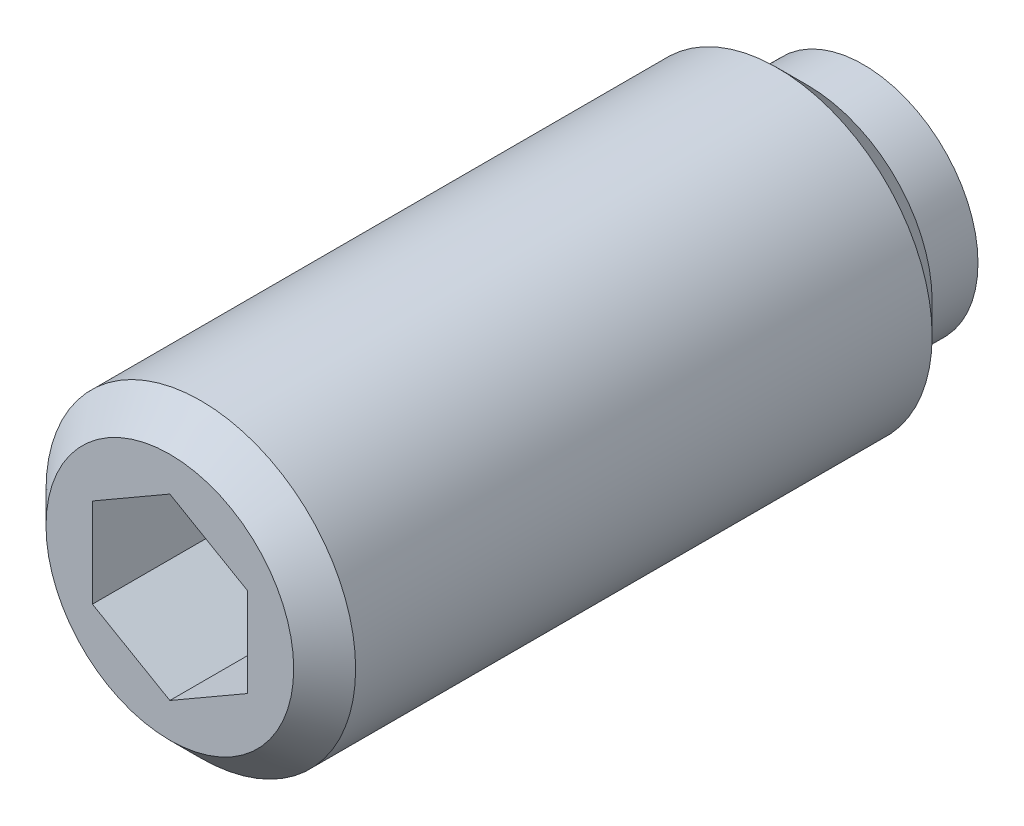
ISO-10303-21;
HEADER;
FILE_DESCRIPTION(('STEP AP214'),'2;1');
FILE_NAME('part.step','',(''),(''),'','','');
FILE_SCHEMA(('AUTOMOTIVE_DESIGN { 1 0 10303 214 1 1 1 1 }'));
ENDSEC;
DATA;
#1=APPLICATION_CONTEXT('core data for automotive mechanical design processes');
#2=APPLICATION_PROTOCOL_DEFINITION('international standard','automotive_design',2000,#1);
#3=PRODUCT_CONTEXT('',#1,'mechanical');
#4=PRODUCT('Part','Part','',(#3));
#5=PRODUCT_RELATED_PRODUCT_CATEGORY('part','',(#4));
#6=PRODUCT_DEFINITION_FORMATION('','',#4);
#7=PRODUCT_DEFINITION_CONTEXT('part definition',#1,'design');
#8=PRODUCT_DEFINITION('design','',#6,#7);
#9=PRODUCT_DEFINITION_SHAPE('','',#8);
#10=(LENGTH_UNIT() NAMED_UNIT(*) SI_UNIT(.MILLI.,.METRE.));
#11=(NAMED_UNIT(*) PLANE_ANGLE_UNIT() SI_UNIT($,.RADIAN.));
#12=(NAMED_UNIT(*) SI_UNIT($,.STERADIAN.) SOLID_ANGLE_UNIT());
#13=UNCERTAINTY_MEASURE_WITH_UNIT(LENGTH_MEASURE(1.E-05),#10,'distance_accuracy_value','');
#14=(GEOMETRIC_REPRESENTATION_CONTEXT(3) GLOBAL_UNCERTAINTY_ASSIGNED_CONTEXT((#13)) GLOBAL_UNIT_ASSIGNED_CONTEXT((#10,
#11,#12)) REPRESENTATION_CONTEXT('',''));
#15=CARTESIAN_POINT('',(0.,0.,0.));
#16=DIRECTION('',(0.,0.,1.));
#17=DIRECTION('',(1.,0.,0.));
#18=AXIS2_PLACEMENT_3D('',#15,#16,#17);
#19=CARTESIAN_POINT('',(0.,0.,1.5));
#20=DIRECTION('',(0.,0.,1.));
#21=DIRECTION('',(1.,0.,0.));
#22=AXIS2_PLACEMENT_3D('',#19,#20,#21);
#23=SPHERICAL_SURFACE('',#22,1.5);
#24=CARTESIAN_POINT('',(0.,0.,0.8));
#25=DIRECTION('',(0.,0.,1.));
#26=DIRECTION('',(1.,0.,0.));
#27=AXIS2_PLACEMENT_3D('',#24,#25,#26);
#28=CIRCLE('',#27,1.32664991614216);
#29=CARTESIAN_POINT('',(1.32664991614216,0.,0.8));
#30=VERTEX_POINT('',#29);
#31=EDGE_CURVE('E85',#30,#30,#28,.T.);
#32=ORIENTED_EDGE('',*,*,#31,.F.);
#33=EDGE_LOOP('',(#32));
#34=FACE_BOUND('',#33,.T.);
#35=ADVANCED_FACE('F14',(#34),#23,.T.);
#36=CARTESIAN_POINT('',(-1.32664991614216,0.,0.8));
#37=DIRECTION('',(0.,0.,1.));
#38=DIRECTION('',(1.,0.,0.));
#39=AXIS2_PLACEMENT_3D('',#36,#37,#38);
#40=PLANE('',#39);
#41=CARTESIAN_POINT('',(0.,0.,0.8));
#42=DIRECTION('',(0.,0.,1.));
#43=DIRECTION('',(1.,0.,0.));
#44=AXIS2_PLACEMENT_3D('',#41,#42,#43);
#45=CIRCLE('',#44,1.85);
#46=CARTESIAN_POINT('',(1.85,0.,0.8));
#47=VERTEX_POINT('',#46);
#48=EDGE_CURVE('E129',#47,#47,#45,.T.);
#49=ORIENTED_EDGE('',*,*,#48,.F.);
#50=EDGE_LOOP('',(#49));
#51=FACE_BOUND('',#50,.T.);
#52=ORIENTED_EDGE('',*,*,#31,.T.);
#53=EDGE_LOOP('',(#52));
#54=FACE_BOUND('',#53,.T.);
#55=ADVANCED_FACE('F159',(#51,#54),#40,.F.);
#56=CARTESIAN_POINT('',(0.,0.,14.8654961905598));
#57=DIRECTION('',(0.,0.,1.));
#58=DIRECTION('',(1.,0.,0.));
#59=AXIS2_PLACEMENT_3D('',#56,#57,#58);
#60=CYLINDRICAL_SURFACE('',#59,1.85);
#61=CARTESIAN_POINT('',(0.,0.,1.7));
#62=DIRECTION('',(0.,0.,1.));
#63=DIRECTION('',(1.,0.,0.));
#64=AXIS2_PLACEMENT_3D('',#61,#62,#63);
#65=CIRCLE('',#64,1.85);
#66=CARTESIAN_POINT('',(1.85,0.,1.7));
#67=VERTEX_POINT('',#66);
#68=EDGE_CURVE('E132',#67,#67,#65,.T.);
#69=ORIENTED_EDGE('',*,*,#68,.F.);
#70=EDGE_LOOP('',(#69));
#71=FACE_BOUND('',#70,.T.);
#72=ORIENTED_EDGE('',*,*,#48,.T.);
#73=EDGE_LOOP('',(#72));
#74=FACE_BOUND('',#73,.T.);
#75=ADVANCED_FACE('F153',(#71,#74),#60,.T.);
#76=CARTESIAN_POINT('',(-2.00949999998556,0.,1.7));
#77=DIRECTION('',(0.,0.,1.));
#78=DIRECTION('',(1.,0.,0.));
#79=AXIS2_PLACEMENT_3D('',#76,#77,#78);
#80=PLANE('',#79);
#81=CARTESIAN_POINT('',(0.,0.,1.7));
#82=DIRECTION('',(0.,0.,1.));
#83=DIRECTION('',(1.,0.,0.));
#84=AXIS2_PLACEMENT_3D('',#81,#82,#83);
#85=CIRCLE('',#84,2.00949999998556);
#86=CARTESIAN_POINT('',(2.00949999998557,0.,1.7));
#87=VERTEX_POINT('',#86);
#88=EDGE_CURVE('E135',#87,#87,#85,.T.);
#89=ORIENTED_EDGE('',*,*,#88,.F.);
#90=EDGE_LOOP('',(#89));
#91=FACE_BOUND('',#90,.T.);
#92=ORIENTED_EDGE('',*,*,#68,.T.);
#93=EDGE_LOOP('',(#92));
#94=FACE_BOUND('',#93,.T.);
#95=ADVANCED_FACE('F147',(#91,#94),#80,.F.);
#96=CARTESIAN_POINT('',(0.,0.,1.7));
#97=DIRECTION('',(0.,0.,1.));
#98=DIRECTION('',(1.,0.,0.));
#99=AXIS2_PLACEMENT_3D('',#96,#97,#98);
#100=CONICAL_SURFACE('',#99,2.00949999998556,0.78539816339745);
#101=CARTESIAN_POINT('',(0.,0.,2.19050000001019));
#102=DIRECTION('',(0.,0.,1.));
#103=DIRECTION('',(1.,0.,0.));
#104=AXIS2_PLACEMENT_3D('',#101,#102,#103);
#105=CIRCLE('',#104,2.49999999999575);
#106=CARTESIAN_POINT('',(2.49999999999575,0.,2.19050000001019));
#107=VERTEX_POINT('',#106);
#108=EDGE_CURVE('E138',#107,#107,#105,.T.);
#109=ORIENTED_EDGE('',*,*,#108,.F.);
#110=EDGE_LOOP('',(#109));
#111=FACE_BOUND('',#110,.T.);
#112=ORIENTED_EDGE('',*,*,#88,.T.);
#113=EDGE_LOOP('',(#112));
#114=FACE_BOUND('',#113,.T.);
#115=ADVANCED_FACE('F144',(#111,#114),#100,.T.);
#116=CARTESIAN_POINT('',(1.25,-0.721687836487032,9.));
#117=DIRECTION('',(-0.5,0.866025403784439,0.));
#118=DIRECTION('',(0.866025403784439,0.5,0.));
#119=AXIS2_PLACEMENT_3D('',#116,#117,#118);
#120=PLANE('',#119);
#121=DIRECTION('',(0.866025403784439,0.5,0.));
#122=VECTOR('',#121,1.);
#123=CARTESIAN_POINT('',(1.25,-0.721687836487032,9.));
#124=LINE('',#123,#122);
#125=CARTESIAN_POINT('',(1.25,-0.721687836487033,9.));
#126=VERTEX_POINT('',#125);
#127=CARTESIAN_POINT('',(0.,-1.44337567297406,9.));
#128=VERTEX_POINT('',#127);
#129=EDGE_CURVE('E84',#126,#128,#124,.F.);
#130=ORIENTED_EDGE('',*,*,#129,.T.);
#131=DIRECTION('',(0.,0.,-1.));
#132=VECTOR('',#131,1.);
#133=CARTESIAN_POINT('',(0.,-1.44337567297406,9.));
#134=LINE('',#133,#132);
#135=CARTESIAN_POINT('',(0.,-1.44337567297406,12.));
#136=VERTEX_POINT('',#135);
#137=EDGE_CURVE('E82',#136,#128,#134,.T.);
#138=ORIENTED_EDGE('',*,*,#137,.F.);
#139=DIRECTION('',(0.866025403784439,0.5,0.));
#140=VECTOR('',#139,1.);
#141=CARTESIAN_POINT('',(1.25,-0.721687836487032,12.));
#142=LINE('',#141,#140);
#143=CARTESIAN_POINT('',(1.25,-0.721687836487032,12.));
#144=VERTEX_POINT('',#143);
#145=EDGE_CURVE('E68',#136,#144,#142,.T.);
#146=ORIENTED_EDGE('',*,*,#145,.T.);
#147=DIRECTION('',(0.,0.,1.));
#148=VECTOR('',#147,1.);
#149=CARTESIAN_POINT('',(1.25,-0.721687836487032,9.));
#150=LINE('',#149,#148);
#151=EDGE_CURVE('E79',#126,#144,#150,.T.);
#152=ORIENTED_EDGE('',*,*,#151,.F.);
#153=EDGE_LOOP('',(#130,#138,#146,#152));
#154=FACE_BOUND('',#153,.T.);
#155=ADVANCED_FACE('F16',(#154),#120,.T.);
#156=CARTESIAN_POINT('',(0.,-1.44337567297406,9.));
#157=DIRECTION('',(0.5,0.866025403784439,0.));
#158=DIRECTION('',(0.866025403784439,-0.5,0.));
#159=AXIS2_PLACEMENT_3D('',#156,#157,#158);
#160=PLANE('',#159);
#161=DIRECTION('',(-0.866025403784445,0.499999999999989,0.));
#162=VECTOR('',#161,1.);
#163=CARTESIAN_POINT('',(-0.625,-1.08253175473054,9.));
#164=LINE('',#163,#162);
#165=CARTESIAN_POINT('',(-1.25,-0.721687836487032,9.));
#166=VERTEX_POINT('',#165);
#167=EDGE_CURVE('E75',#128,#166,#164,.T.);
#168=ORIENTED_EDGE('',*,*,#167,.T.);
#169=DIRECTION('',(0.,0.,-1.));
#170=VECTOR('',#169,1.);
#171=CARTESIAN_POINT('',(-1.25,-0.721687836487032,9.));
#172=LINE('',#171,#170);
#173=CARTESIAN_POINT('',(-1.25,-0.721687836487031,12.));
#174=VERTEX_POINT('',#173);
#175=EDGE_CURVE('E91',#174,#166,#172,.T.);
#176=ORIENTED_EDGE('',*,*,#175,.F.);
#177=DIRECTION('',(0.866025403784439,-0.5,0.));
#178=VECTOR('',#177,1.);
#179=CARTESIAN_POINT('',(0.,-1.44337567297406,12.));
#180=LINE('',#179,#178);
#181=EDGE_CURVE('E97',#174,#136,#180,.T.);
#182=ORIENTED_EDGE('',*,*,#181,.T.);
#183=ORIENTED_EDGE('',*,*,#137,.T.);
#184=EDGE_LOOP('',(#168,#176,#182,#183));
#185=FACE_BOUND('',#184,.T.);
#186=ADVANCED_FACE('F199',(#185),#160,.T.);
#187=CARTESIAN_POINT('',(1.25,0.721687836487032,9.));
#188=DIRECTION('',(-1.,0.,0.));
#189=DIRECTION('',(0.,0.,1.));
#190=AXIS2_PLACEMENT_3D('',#187,#188,#189);
#191=PLANE('',#190);
#192=DIRECTION('',(0.,1.,0.));
#193=VECTOR('',#192,1.);
#194=CARTESIAN_POINT('',(1.25,0.721687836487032,9.));
#195=LINE('',#194,#193);
#196=CARTESIAN_POINT('',(1.25,0.721687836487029,9.));
#197=VERTEX_POINT('',#196);
#198=EDGE_CURVE('E74',#197,#126,#195,.F.);
#199=ORIENTED_EDGE('',*,*,#198,.T.);
#200=ORIENTED_EDGE('',*,*,#151,.T.);
#201=DIRECTION('',(0.,1.,0.));
#202=VECTOR('',#201,1.);
#203=CARTESIAN_POINT('',(1.25,0.721687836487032,12.));
#204=LINE('',#203,#202);
#205=CARTESIAN_POINT('',(1.25,0.721687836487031,12.));
#206=VERTEX_POINT('',#205);
#207=EDGE_CURVE('E64',#144,#206,#204,.T.);
#208=ORIENTED_EDGE('',*,*,#207,.T.);
#209=DIRECTION('',(0.,0.,-1.));
#210=VECTOR('',#209,1.);
#211=CARTESIAN_POINT('',(1.25,0.721687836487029,9.));
#212=LINE('',#211,#210);
#213=EDGE_CURVE('E106',#197,#206,#212,.F.);
#214=ORIENTED_EDGE('',*,*,#213,.F.);
#215=EDGE_LOOP('',(#199,#200,#208,#214));
#216=FACE_BOUND('',#215,.T.);
#217=ADVANCED_FACE('F87',(#216),#191,.T.);
#218=CARTESIAN_POINT('',(-1.25,-0.721687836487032,9.));
#219=DIRECTION('',(1.,0.,0.));
#220=DIRECTION('',(0.,0.,-1.));
#221=AXIS2_PLACEMENT_3D('',#218,#219,#220);
#222=PLANE('',#221);
#223=DIRECTION('',(0.,1.,0.));
#224=VECTOR('',#223,1.);
#225=CARTESIAN_POINT('',(-1.25,0.,9.));
#226=LINE('',#225,#224);
#227=CARTESIAN_POINT('',(-1.25,0.721687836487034,9.));
#228=VERTEX_POINT('',#227);
#229=EDGE_CURVE('E103',#166,#228,#226,.T.);
#230=ORIENTED_EDGE('',*,*,#229,.T.);
#231=DIRECTION('',(0.,0.,-1.));
#232=VECTOR('',#231,1.);
#233=CARTESIAN_POINT('',(-1.25,0.721687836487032,9.));
#234=LINE('',#233,#232);
#235=CARTESIAN_POINT('',(-1.25,0.721687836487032,12.));
#236=VERTEX_POINT('',#235);
#237=EDGE_CURVE('E108',#236,#228,#234,.T.);
#238=ORIENTED_EDGE('',*,*,#237,.F.);
#239=DIRECTION('',(0.,1.,0.));
#240=VECTOR('',#239,1.);
#241=CARTESIAN_POINT('',(-1.25,-0.721687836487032,12.));
#242=LINE('',#241,#240);
#243=EDGE_CURVE('E88',#236,#174,#242,.F.);
#244=ORIENTED_EDGE('',*,*,#243,.T.);
#245=ORIENTED_EDGE('',*,*,#175,.T.);
#246=EDGE_LOOP('',(#230,#238,#244,#245));
#247=FACE_BOUND('',#246,.T.);
#248=ADVANCED_FACE('F193',(#247),#222,.T.);
#249=CARTESIAN_POINT('',(0.,0.,9.));
#250=DIRECTION('',(0.,0.,-1.));
#251=DIRECTION('',(-1.,0.,0.));
#252=AXIS2_PLACEMENT_3D('',#249,#250,#251);
#253=PLANE('',#252);
#254=DIRECTION('',(-0.866025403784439,0.5,0.));
#255=VECTOR('',#254,1.);
#256=CARTESIAN_POINT('',(0.,1.44337567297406,9.));
#257=LINE('',#256,#255);
#258=CARTESIAN_POINT('',(0.,1.44337567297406,9.));
#259=VERTEX_POINT('',#258);
#260=EDGE_CURVE('E109',#259,#197,#257,.F.);
#261=ORIENTED_EDGE('',*,*,#260,.F.);
#262=DIRECTION('',(-0.866025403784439,-0.5,0.));
#263=VECTOR('',#262,1.);
#264=CARTESIAN_POINT('',(-1.25,0.721687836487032,9.));
#265=LINE('',#264,#263);
#266=EDGE_CURVE('E118',#228,#259,#265,.F.);
#267=ORIENTED_EDGE('',*,*,#266,.F.);
#268=ORIENTED_EDGE('',*,*,#229,.F.);
#269=ORIENTED_EDGE('',*,*,#167,.F.);
#270=ORIENTED_EDGE('',*,*,#129,.F.);
#271=ORIENTED_EDGE('',*,*,#198,.F.);
#272=EDGE_LOOP('',(#261,#267,#268,#269,#270,#271));
#273=FACE_BOUND('',#272,.T.);
#274=ADVANCED_FACE('F190',(#273),#253,.F.);
#275=CARTESIAN_POINT('',(0.,1.44337567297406,9.));
#276=DIRECTION('',(-0.5,-0.866025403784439,0.));
#277=DIRECTION('',(-0.866025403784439,0.5,0.));
#278=AXIS2_PLACEMENT_3D('',#275,#276,#277);
#279=PLANE('',#278);
#280=ORIENTED_EDGE('',*,*,#260,.T.);
#281=ORIENTED_EDGE('',*,*,#213,.T.);
#282=DIRECTION('',(-0.866025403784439,0.5,0.));
#283=VECTOR('',#282,1.);
#284=CARTESIAN_POINT('',(0.,1.44337567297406,12.));
#285=LINE('',#284,#283);
#286=CARTESIAN_POINT('',(0.,1.44337567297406,12.));
#287=VERTEX_POINT('',#286);
#288=EDGE_CURVE('E32',#206,#287,#285,.T.);
#289=ORIENTED_EDGE('',*,*,#288,.T.);
#290=DIRECTION('',(0.,0.,-1.));
#291=VECTOR('',#290,1.);
#292=CARTESIAN_POINT('',(0.,1.44337567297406,9.));
#293=LINE('',#292,#291);
#294=EDGE_CURVE('E114',#259,#287,#293,.F.);
#295=ORIENTED_EDGE('',*,*,#294,.F.);
#296=EDGE_LOOP('',(#280,#281,#289,#295));
#297=FACE_BOUND('',#296,.T.);
#298=ADVANCED_FACE('F186',(#297),#279,.T.);
#299=CARTESIAN_POINT('',(-1.25,0.721687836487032,9.));
#300=DIRECTION('',(0.5,-0.866025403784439,0.));
#301=DIRECTION('',(-0.866025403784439,-0.5,0.));
#302=AXIS2_PLACEMENT_3D('',#299,#300,#301);
#303=PLANE('',#302);
#304=ORIENTED_EDGE('',*,*,#266,.T.);
#305=ORIENTED_EDGE('',*,*,#294,.T.);
#306=DIRECTION('',(-0.86602540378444,-0.5,0.));
#307=VECTOR('',#306,1.);
#308=CARTESIAN_POINT('',(0.,1.44337567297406,12.));
#309=LINE('',#308,#307);
#310=EDGE_CURVE('E112',#287,#236,#309,.T.);
#311=ORIENTED_EDGE('',*,*,#310,.T.);
#312=ORIENTED_EDGE('',*,*,#237,.T.);
#313=EDGE_LOOP('',(#304,#305,#311,#312));
#314=FACE_BOUND('',#313,.T.);
#315=ADVANCED_FACE('F183',(#314),#303,.T.);
#316=CARTESIAN_POINT('',(0.,0.,12.));
#317=DIRECTION('',(0.,0.,-1.));
#318=DIRECTION('',(-1.,0.,0.));
#319=AXIS2_PLACEMENT_3D('',#316,#317,#318);
#320=PLANE('',#319);
#321=ORIENTED_EDGE('',*,*,#288,.F.);
#322=ORIENTED_EDGE('',*,*,#207,.F.);
#323=ORIENTED_EDGE('',*,*,#145,.F.);
#324=ORIENTED_EDGE('',*,*,#181,.F.);
#325=ORIENTED_EDGE('',*,*,#243,.F.);
#326=ORIENTED_EDGE('',*,*,#310,.F.);
#327=EDGE_LOOP('',(#321,#322,#323,#324,#325,#326));
#328=FACE_BOUND('',#327,.T.);
#329=CARTESIAN_POINT('',(0.,0.,12.));
#330=DIRECTION('',(0.,0.,-1.));
#331=DIRECTION('',(-1.,0.,0.));
#332=AXIS2_PLACEMENT_3D('',#329,#330,#331);
#333=CIRCLE('',#332,1.9999999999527);
#334=CARTESIAN_POINT('',(-1.9999999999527,0.,12.));
#335=VERTEX_POINT('',#334);
#336=EDGE_CURVE('E18',#335,#335,#333,.T.);
#337=ORIENTED_EDGE('',*,*,#336,.F.);
#338=EDGE_LOOP('',(#337));
#339=FACE_BOUND('',#338,.T.);
#340=ADVANCED_FACE('F66',(#328,#339),#320,.F.);
#341=CARTESIAN_POINT('',(0.,0.,11.4999999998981));
#342=DIRECTION('',(0.,0.,-1.));
#343=DIRECTION('',(-1.,0.,0.));
#344=AXIS2_PLACEMENT_3D('',#341,#342,#343);
#345=CONICAL_SURFACE('',#344,2.50000000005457,0.785398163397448);
#346=ORIENTED_EDGE('',*,*,#336,.T.);
#347=EDGE_LOOP('',(#346));
#348=FACE_BOUND('',#347,.T.);
#349=CARTESIAN_POINT('',(0.,0.,11.5));
#350=DIRECTION('',(0.,0.,1.));
#351=DIRECTION('',(1.,0.,0.));
#352=AXIS2_PLACEMENT_3D('',#349,#350,#351);
#353=CIRCLE('',#352,2.5);
#354=CARTESIAN_POINT('',(2.5,0.,11.5));
#355=VERTEX_POINT('',#354);
#356=EDGE_CURVE('E9',#355,#355,#353,.F.);
#357=ORIENTED_EDGE('',*,*,#356,.F.);
#358=EDGE_LOOP('',(#357));
#359=FACE_BOUND('',#358,.T.);
#360=ADVANCED_FACE('F176',(#348,#359),#345,.T.);
#361=CARTESIAN_POINT('',(0.,0.,4.8));
#362=DIRECTION('',(0.,0.,1.));
#363=DIRECTION('',(1.,0.,0.));
#364=AXIS2_PLACEMENT_3D('',#361,#362,#363);
#365=CYLINDRICAL_SURFACE('',#364,2.5);
#366=ORIENTED_EDGE('',*,*,#356,.T.);
#367=EDGE_LOOP('',(#366));
#368=FACE_BOUND('',#367,.T.);
#369=ORIENTED_EDGE('',*,*,#108,.T.);
#370=EDGE_LOOP('',(#369));
#371=FACE_BOUND('',#370,.T.);
#372=ADVANCED_FACE('F142',(#368,#371),#365,.T.);
#373=CLOSED_SHELL('',(#35,#55,#75,#95,#115,#155,#186,#217,#248,#274,#298,#315,#340,#360,#372));
#374=MANIFOLD_SOLID_BREP('B1',#373);
#375=ADVANCED_BREP_SHAPE_REPRESENTATION('',(#18,#374),#14);
#376=SHAPE_DEFINITION_REPRESENTATION(#9,#375);
ENDSEC;
END-ISO-10303-21;
